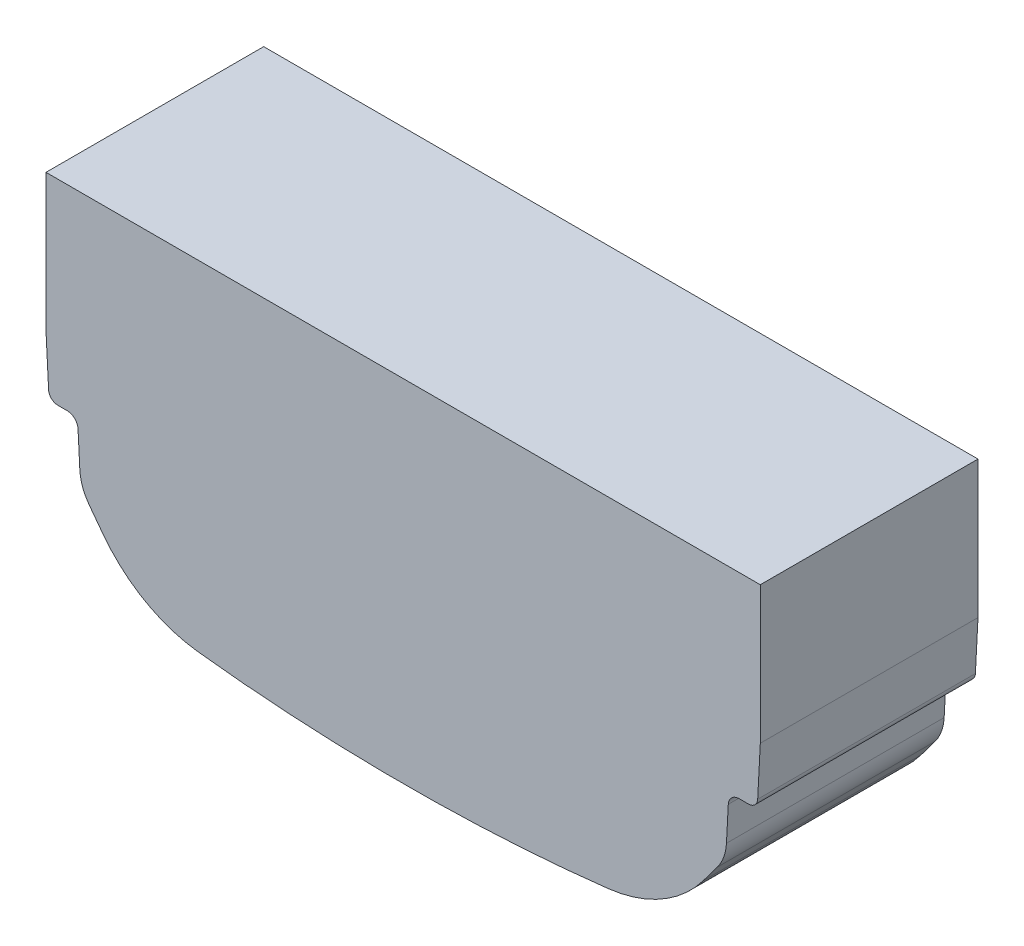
from build123d import *

# Parameters (mm, degrees)
BOSS_EXTRUDE1_DEPTH = 129.5


with BuildPart() as part:
    # Sketch1 → Boss-Extrude1 (new body)
    with BuildSketch(Plane.XY.offset(64.75)):
        with BuildLine():
            Line((212.453485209, -15.999999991), (-212.453485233, -15.999999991))
            Line((-212.453485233, -15.999999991), (-212.453485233, -97.659816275))
            Line((-212.453485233, -97.659816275), (-210.900745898, -127.28784775))
            ThreePointArc((-210.900745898, -127.28784775), (-209.194233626, -130.989559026), (-205.408283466, -132.499999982))
            Line((-205.408283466, -132.499999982), (-199.892169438, -132.499999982))
            ThreePointArc((-199.892169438, -132.499999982), (-195.417864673, -134.285066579), (-193.401077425, -138.659816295))
            Line((-193.401077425, -138.659816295), (-192.321408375, -159.261128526))
            ThreePointArc((-192.321408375, -159.261128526), (-190.715694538, -167.185987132), (-186.874544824, -174.301271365))
            ThreePointArc((-186.874544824, -174.301271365), (-182.717820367, -179.845145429), (-178.552225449, -185.382357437))
            ThreePointArc((-178.552225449, -185.382357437), (-153.693494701, -207.326362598), (-122.21338872, -217.742637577))
            add(Edge.make_bspline(
                [(-122.21338872, -217.742637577), (-101.94589173, -220.139537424), (-61.250097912, -223.58884422), (0.011268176, -225.264906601), (61.26974393, -223.587529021), (101.951389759, -220.138887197), (122.21338861, -217.742637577)],
                knots=[0, 0, 0, 0, 0.25, 0.5, 0.75, 1, 1, 1, 1], degree=3))
            ThreePointArc((122.21338861, -217.742637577), (153.693494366, -207.326362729), (178.552225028, -185.382357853))
            ThreePointArc((178.552225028, -185.382357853), (182.717820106, -179.845145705), (186.874544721, -174.301271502))
            ThreePointArc((186.874544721, -174.301271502), (190.715694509, -167.185987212), (192.321408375, -159.261128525))
            Line((192.321408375, -159.261128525), (193.401077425, -138.659816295))
            ThreePointArc((193.401077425, -138.659816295), (195.417864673, -134.285066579), (199.892169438, -132.499999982))
            Line((199.892169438, -132.499999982), (205.408283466, -132.499999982))
            ThreePointArc((205.408283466, -132.499999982), (209.194233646, -130.989559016), (210.900745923, -127.287847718))
            Line((210.900745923, -127.287847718), (212.453485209, -97.659816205))
            Line((212.453485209, -97.659816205), (212.453485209, -15.999999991))
        make_face()
    extrude(amount=-BOSS_EXTRUDE1_DEPTH)


solid = part.part
